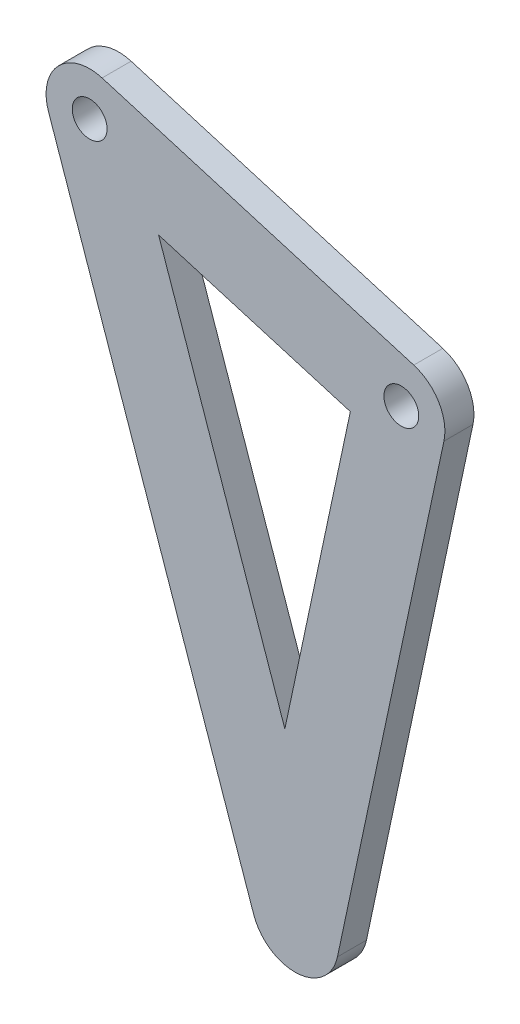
ISO-10303-21;
HEADER;
FILE_DESCRIPTION(('STEP AP214'),'2;1');
FILE_NAME('part.step','',(''),(''),'','','');
FILE_SCHEMA(('AUTOMOTIVE_DESIGN { 1 0 10303 214 1 1 1 1 }'));
ENDSEC;
DATA;
#1=APPLICATION_CONTEXT('core data for automotive mechanical design processes');
#2=APPLICATION_PROTOCOL_DEFINITION('international standard','automotive_design',2000,#1);
#3=PRODUCT_CONTEXT('',#1,'mechanical');
#4=PRODUCT('Part','Part','',(#3));
#5=PRODUCT_RELATED_PRODUCT_CATEGORY('part','',(#4));
#6=PRODUCT_DEFINITION_FORMATION('','',#4);
#7=PRODUCT_DEFINITION_CONTEXT('part definition',#1,'design');
#8=PRODUCT_DEFINITION('design','',#6,#7);
#9=PRODUCT_DEFINITION_SHAPE('','',#8);
#10=(LENGTH_UNIT() NAMED_UNIT(*) SI_UNIT(.MILLI.,.METRE.));
#11=(NAMED_UNIT(*) PLANE_ANGLE_UNIT() SI_UNIT($,.RADIAN.));
#12=(NAMED_UNIT(*) SI_UNIT($,.STERADIAN.) SOLID_ANGLE_UNIT());
#13=UNCERTAINTY_MEASURE_WITH_UNIT(LENGTH_MEASURE(1.E-05),#10,'distance_accuracy_value','');
#14=(GEOMETRIC_REPRESENTATION_CONTEXT(3) GLOBAL_UNCERTAINTY_ASSIGNED_CONTEXT((#13)) GLOBAL_UNIT_ASSIGNED_CONTEXT((#10,
#11,#12)) REPRESENTATION_CONTEXT('',''));
#15=CARTESIAN_POINT('',(0.,0.,0.));
#16=DIRECTION('',(0.,0.,1.));
#17=DIRECTION('',(1.,0.,0.));
#18=AXIS2_PLACEMENT_3D('',#15,#16,#17);
#19=CARTESIAN_POINT('',(-76.8798993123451,16.3749967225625,-5.));
#20=DIRECTION('',(-0.978060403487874,0.208321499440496,0.));
#21=DIRECTION('',(-0.208321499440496,-0.978060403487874,0.));
#22=AXIS2_PLACEMENT_3D('',#19,#20,#21);
#23=PLANE('',#22);
#24=DIRECTION('',(-0.208321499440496,-0.978060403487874,0.));
#25=VECTOR('',#24,1.);
#26=CARTESIAN_POINT('',(-76.8798993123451,16.3749967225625,0.));
#27=LINE('',#26,#25);
#28=CARTESIAN_POINT('',(-93.4175999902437,-61.2687906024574,0.));
#29=VERTEX_POINT('',#28);
#30=CARTESIAN_POINT('',(-104.696691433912,-114.223635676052,0.));
#31=VERTEX_POINT('',#30);
#32=EDGE_CURVE('E156',#29,#31,#27,.T.);
#33=ORIENTED_EDGE('',*,*,#32,.F.);
#34=DIRECTION('',(0.,0.,1.));
#35=VECTOR('',#34,1.);
#36=CARTESIAN_POINT('',(-93.4175999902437,-61.2687906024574,-5.));
#37=LINE('',#36,#35);
#38=CARTESIAN_POINT('',(-93.4175999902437,-61.2687906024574,-5.));
#39=VERTEX_POINT('',#38);
#40=EDGE_CURVE('E11',#39,#29,#37,.T.);
#41=ORIENTED_EDGE('',*,*,#40,.F.);
#42=DIRECTION('',(-0.208321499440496,-0.978060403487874,0.));
#43=VECTOR('',#42,1.);
#44=CARTESIAN_POINT('',(-76.8798993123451,16.3749967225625,-5.));
#45=LINE('',#44,#43);
#46=CARTESIAN_POINT('',(-104.696691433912,-114.223635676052,-5.));
#47=VERTEX_POINT('',#46);
#48=EDGE_CURVE('E127',#39,#47,#45,.T.);
#49=ORIENTED_EDGE('',*,*,#48,.T.);
#50=DIRECTION('',(0.,0.,1.));
#51=VECTOR('',#50,1.);
#52=CARTESIAN_POINT('',(-104.696691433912,-114.223635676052,-5.));
#53=LINE('',#52,#51);
#54=EDGE_CURVE('E116',#47,#31,#53,.T.);
#55=ORIENTED_EDGE('',*,*,#54,.T.);
#56=EDGE_LOOP('',(#33,#41,#49,#55));
#57=FACE_BOUND('',#56,.T.);
#58=ADVANCED_FACE('F39',(#57),#23,.T.);
#59=CARTESIAN_POINT('',(-24.3745831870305,-81.8336231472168,-5.));
#60=DIRECTION('',(-0.285461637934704,-0.958390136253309,0.));
#61=DIRECTION('',(0.958390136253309,-0.285461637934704,0.));
#62=AXIS2_PLACEMENT_3D('',#59,#60,#61);
#63=PLANE('',#62);
#64=DIRECTION('',(0.958390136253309,-0.285461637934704,0.));
#65=VECTOR('',#64,1.);
#66=CARTESIAN_POINT('',(-24.3745831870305,-81.8336231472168,0.));
#67=LINE('',#66,#65);
#68=CARTESIAN_POINT('',(-126.438409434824,-51.4333655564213,0.));
#69=VERTEX_POINT('',#68);
#70=EDGE_CURVE('E159',#69,#29,#67,.T.);
#71=ORIENTED_EDGE('',*,*,#70,.F.);
#72=DIRECTION('',(0.,0.,1.));
#73=VECTOR('',#72,1.);
#74=CARTESIAN_POINT('',(-126.438409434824,-51.4333655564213,-5.));
#75=LINE('',#74,#73);
#76=CARTESIAN_POINT('',(-126.438409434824,-51.4333655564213,-5.));
#77=VERTEX_POINT('',#76);
#78=EDGE_CURVE('E49',#77,#69,#75,.T.);
#79=ORIENTED_EDGE('',*,*,#78,.F.);
#80=DIRECTION('',(0.958390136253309,-0.285461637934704,0.));
#81=VECTOR('',#80,1.);
#82=CARTESIAN_POINT('',(-24.3745831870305,-81.8336231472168,-5.));
#83=LINE('',#82,#81);
#84=EDGE_CURVE('E128',#77,#39,#83,.T.);
#85=ORIENTED_EDGE('',*,*,#84,.T.);
#86=ORIENTED_EDGE('',*,*,#40,.T.);
#87=EDGE_LOOP('',(#71,#79,#85,#86));
#88=FACE_BOUND('',#87,.T.);
#89=ADVANCED_FACE('F228',(#88),#63,.T.);
#90=CARTESIAN_POINT('',(-142.978925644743,-49.5077895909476,-5.));
#91=DIRECTION('',(0.944955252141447,0.327199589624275,0.));
#92=DIRECTION('',(-0.327199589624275,0.944955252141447,0.));
#93=AXIS2_PLACEMENT_3D('',#90,#91,#92);
#94=PLANE('',#93);
#95=DIRECTION('',(-0.327199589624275,0.944955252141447,0.));
#96=VECTOR('',#95,1.);
#97=CARTESIAN_POINT('',(-142.978925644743,-49.5077895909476,0.));
#98=LINE('',#97,#96);
#99=CARTESIAN_POINT('',(-110.058903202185,-144.581099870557,0.));
#100=VERTEX_POINT('',#99);
#101=CARTESIAN_POINT('',(-145.396458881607,-42.5259326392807,0.));
#102=VERTEX_POINT('',#101);
#103=EDGE_CURVE('E138',#100,#102,#98,.T.);
#104=ORIENTED_EDGE('',*,*,#103,.T.);
#105=DIRECTION('',(0.,0.,1.));
#106=VECTOR('',#105,1.);
#107=CARTESIAN_POINT('',(-145.396458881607,-42.5259326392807,-5.));
#108=LINE('',#107,#106);
#109=CARTESIAN_POINT('',(-145.396458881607,-42.5259326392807,-5.));
#110=VERTEX_POINT('',#109);
#111=EDGE_CURVE('E123',#110,#102,#108,.T.);
#112=ORIENTED_EDGE('',*,*,#111,.F.);
#113=DIRECTION('',(-0.327199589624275,0.944955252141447,0.));
#114=VECTOR('',#113,1.);
#115=CARTESIAN_POINT('',(-142.978925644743,-49.5077895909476,-5.));
#116=LINE('',#115,#114);
#117=CARTESIAN_POINT('',(-110.058903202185,-144.581099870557,-5.));
#118=VERTEX_POINT('',#117);
#119=EDGE_CURVE('E161',#118,#110,#116,.T.);
#120=ORIENTED_EDGE('',*,*,#119,.F.);
#121=DIRECTION('',(0.,0.,1.));
#122=VECTOR('',#121,1.);
#123=CARTESIAN_POINT('',(-110.058903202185,-144.581099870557,-5.));
#124=LINE('',#123,#122);
#125=EDGE_CURVE('E99',#118,#100,#124,.T.);
#126=ORIENTED_EDGE('',*,*,#125,.T.);
#127=EDGE_LOOP('',(#104,#112,#120,#126));
#128=FACE_BOUND('',#127,.T.);
#129=ADVANCED_FACE('F41',(#128),#94,.F.);
#130=CARTESIAN_POINT('',(-138.309294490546,-40.0719357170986,-5.));
#131=DIRECTION('',(0.,0.,1.));
#132=DIRECTION('',(1.,0.,0.));
#133=AXIS2_PLACEMENT_3D('',#130,#131,#132);
#134=CYLINDRICAL_SURFACE('',#133,7.50000000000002);
#135=CARTESIAN_POINT('',(-138.309294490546,-40.0719357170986,0.));
#136=DIRECTION('',(0.,0.,1.));
#137=DIRECTION('',(1.,0.,0.));
#138=AXIS2_PLACEMENT_3D('',#135,#136,#137);
#139=CIRCLE('',#138,7.50000000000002);
#140=CARTESIAN_POINT('',(-136.168332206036,-32.8840096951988,0.));
#141=VERTEX_POINT('',#140);
#142=EDGE_CURVE('E153',#141,#102,#139,.T.);
#143=ORIENTED_EDGE('',*,*,#142,.F.);
#144=DIRECTION('',(0.,0.,1.));
#145=VECTOR('',#144,1.);
#146=CARTESIAN_POINT('',(-136.168332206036,-32.8840096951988,-5.));
#147=LINE('',#146,#145);
#148=CARTESIAN_POINT('',(-136.168332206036,-32.8840096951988,-5.));
#149=VERTEX_POINT('',#148);
#150=EDGE_CURVE('E165',#149,#141,#147,.T.);
#151=ORIENTED_EDGE('',*,*,#150,.F.);
#152=CARTESIAN_POINT('',(-138.309294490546,-40.0719357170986,-5.));
#153=DIRECTION('',(0.,0.,1.));
#154=DIRECTION('',(1.,0.,0.));
#155=AXIS2_PLACEMENT_3D('',#152,#153,#154);
#156=CIRCLE('',#155,7.50000000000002);
#157=EDGE_CURVE('E130',#149,#110,#156,.T.);
#158=ORIENTED_EDGE('',*,*,#157,.T.);
#159=ORIENTED_EDGE('',*,*,#111,.T.);
#160=EDGE_LOOP('',(#143,#151,#158,#159));
#161=FACE_BOUND('',#160,.T.);
#162=ADVANCED_FACE('F220',(#161),#134,.T.);
#163=CARTESIAN_POINT('',(-20.0926586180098,-67.457771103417,-5.));
#164=DIRECTION('',(-0.285461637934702,-0.95839013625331,0.));
#165=DIRECTION('',(0.95839013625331,-0.285461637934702,0.));
#166=AXIS2_PLACEMENT_3D('',#163,#164,#165);
#167=PLANE('',#166);
#168=DIRECTION('',(0.958390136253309,-0.285461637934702,0.));
#169=VECTOR('',#168,1.);
#170=CARTESIAN_POINT('',(-20.0926586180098,-67.457771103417,0.));
#171=LINE('',#170,#169);
#172=CARTESIAN_POINT('',(-82.4984845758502,-48.8698614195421,0.));
#173=VERTEX_POINT('',#172);
#174=EDGE_CURVE('E150',#141,#173,#171,.T.);
#175=ORIENTED_EDGE('',*,*,#174,.T.);
#176=DIRECTION('',(0.,0.,1.));
#177=VECTOR('',#176,1.);
#178=CARTESIAN_POINT('',(-82.4984845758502,-48.8698614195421,-5.));
#179=LINE('',#178,#177);
#180=CARTESIAN_POINT('',(-82.4984845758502,-48.8698614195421,-5.));
#181=VERTEX_POINT('',#180);
#182=EDGE_CURVE('E167',#181,#173,#179,.T.);
#183=ORIENTED_EDGE('',*,*,#182,.F.);
#184=DIRECTION('',(0.958390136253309,-0.285461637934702,0.));
#185=VECTOR('',#184,1.);
#186=CARTESIAN_POINT('',(-20.0926586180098,-67.457771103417,-5.));
#187=LINE('',#186,#185);
#188=EDGE_CURVE('E133',#149,#181,#187,.T.);
#189=ORIENTED_EDGE('',*,*,#188,.F.);
#190=ORIENTED_EDGE('',*,*,#150,.T.);
#191=EDGE_LOOP('',(#175,#183,#189,#190));
#192=FACE_BOUND('',#191,.T.);
#193=ADVANCED_FACE('F200',(#192),#167,.F.);
#194=CARTESIAN_POINT('',(-84.6394468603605,-56.057787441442,-5.));
#195=DIRECTION('',(0.,0.,1.));
#196=DIRECTION('',(1.,0.,0.));
#197=AXIS2_PLACEMENT_3D('',#194,#195,#196);
#198=CYLINDRICAL_SURFACE('',#197,7.50000000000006);
#199=CARTESIAN_POINT('',(-84.6394468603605,-56.057787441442,0.));
#200=DIRECTION('',(0.,0.,1.));
#201=DIRECTION('',(1.,0.,0.));
#202=AXIS2_PLACEMENT_3D('',#199,#200,#201);
#203=CIRCLE('',#202,7.50000000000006);
#204=CARTESIAN_POINT('',(-77.3039938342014,-57.6201986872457,0.));
#205=VERTEX_POINT('',#204);
#206=EDGE_CURVE('E147',#205,#173,#203,.T.);
#207=ORIENTED_EDGE('',*,*,#206,.F.);
#208=DIRECTION('',(0.,0.,1.));
#209=VECTOR('',#208,1.);
#210=CARTESIAN_POINT('',(-77.3039938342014,-57.6201986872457,-5.));
#211=LINE('',#210,#209);
#212=CARTESIAN_POINT('',(-77.3039938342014,-57.6201986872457,-5.));
#213=VERTEX_POINT('',#212);
#214=EDGE_CURVE('E169',#213,#205,#211,.T.);
#215=ORIENTED_EDGE('',*,*,#214,.F.);
#216=CARTESIAN_POINT('',(-84.6394468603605,-56.057787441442,-5.));
#217=DIRECTION('',(0.,0.,1.));
#218=DIRECTION('',(1.,0.,0.));
#219=AXIS2_PLACEMENT_3D('',#216,#217,#218);
#220=CIRCLE('',#219,7.50000000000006);
#221=EDGE_CURVE('E192',#213,#181,#220,.T.);
#222=ORIENTED_EDGE('',*,*,#221,.T.);
#223=ORIENTED_EDGE('',*,*,#182,.T.);
#224=EDGE_LOOP('',(#207,#215,#222,#223));
#225=FACE_BOUND('',#224,.T.);
#226=ADVANCED_FACE('F204',(#225),#198,.T.);
#227=CARTESIAN_POINT('',(-62.208993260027,13.250174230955,-5.));
#228=DIRECTION('',(-0.978060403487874,0.208321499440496,0.));
#229=DIRECTION('',(-0.208321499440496,-0.978060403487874,0.));
#230=AXIS2_PLACEMENT_3D('',#227,#228,#229);
#231=PLANE('',#230);
#232=DIRECTION('',(-0.208321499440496,-0.978060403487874,0.));
#233=VECTOR('',#232,1.);
#234=CARTESIAN_POINT('',(-62.208993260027,13.250174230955,0.));
#235=LINE('',#234,#233);
#236=CARTESIAN_POINT('',(-95.636285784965,-143.689514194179,0.));
#237=VERTEX_POINT('',#236);
#238=EDGE_CURVE('E144',#205,#237,#235,.T.);
#239=ORIENTED_EDGE('',*,*,#238,.T.);
#240=DIRECTION('',(0.,0.,1.));
#241=VECTOR('',#240,1.);
#242=CARTESIAN_POINT('',(-95.636285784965,-143.689514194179,-5.));
#243=LINE('',#242,#241);
#244=CARTESIAN_POINT('',(-95.636285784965,-143.689514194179,-5.));
#245=VERTEX_POINT('',#244);
#246=EDGE_CURVE('E171',#245,#237,#243,.T.);
#247=ORIENTED_EDGE('',*,*,#246,.F.);
#248=DIRECTION('',(-0.208321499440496,-0.978060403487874,0.));
#249=VECTOR('',#248,1.);
#250=CARTESIAN_POINT('',(-62.208993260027,13.250174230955,-5.));
#251=LINE('',#250,#249);
#252=EDGE_CURVE('E190',#213,#245,#251,.T.);
#253=ORIENTED_EDGE('',*,*,#252,.F.);
#254=ORIENTED_EDGE('',*,*,#214,.T.);
#255=EDGE_LOOP('',(#239,#247,#253,#254));
#256=FACE_BOUND('',#255,.T.);
#257=ADVANCED_FACE('F209',(#256),#231,.F.);
#258=CARTESIAN_POINT('',(-102.971738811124,-142.127102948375,-5.));
#259=DIRECTION('',(0.,0.,1.));
#260=DIRECTION('',(1.,0.,0.));
#261=AXIS2_PLACEMENT_3D('',#258,#259,#260);
#262=CYLINDRICAL_SURFACE('',#261,7.50000000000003);
#263=CARTESIAN_POINT('',(-102.971738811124,-142.127102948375,0.));
#264=DIRECTION('',(0.,0.,1.));
#265=DIRECTION('',(1.,0.,0.));
#266=AXIS2_PLACEMENT_3D('',#263,#264,#265);
#267=CIRCLE('',#266,7.50000000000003);
#268=EDGE_CURVE('E141',#100,#237,#267,.T.);
#269=ORIENTED_EDGE('',*,*,#268,.F.);
#270=ORIENTED_EDGE('',*,*,#125,.F.);
#271=CARTESIAN_POINT('',(-102.971738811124,-142.127102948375,-5.));
#272=DIRECTION('',(0.,0.,1.));
#273=DIRECTION('',(1.,0.,0.));
#274=AXIS2_PLACEMENT_3D('',#271,#272,#273);
#275=CIRCLE('',#274,7.50000000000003);
#276=EDGE_CURVE('E188',#118,#245,#275,.T.);
#277=ORIENTED_EDGE('',*,*,#276,.T.);
#278=ORIENTED_EDGE('',*,*,#246,.T.);
#279=EDGE_LOOP('',(#269,#270,#277,#278));
#280=FACE_BOUND('',#279,.T.);
#281=ADVANCED_FACE('F212',(#280),#262,.T.);
#282=CARTESIAN_POINT('',(-128.804596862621,-44.5997957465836,-5.));
#283=DIRECTION('',(0.944955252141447,0.327199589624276,0.));
#284=DIRECTION('',(-0.327199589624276,0.944955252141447,0.));
#285=AXIS2_PLACEMENT_3D('',#282,#283,#284);
#286=PLANE('',#285);
#287=DIRECTION('',(-0.327199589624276,0.944955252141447,0.));
#288=VECTOR('',#287,1.);
#289=CARTESIAN_POINT('',(-128.804596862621,-44.5997957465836,0.));
#290=LINE('',#289,#288);
#291=EDGE_CURVE('E121',#31,#69,#290,.T.);
#292=ORIENTED_EDGE('',*,*,#291,.F.);
#293=ORIENTED_EDGE('',*,*,#54,.F.);
#294=DIRECTION('',(-0.327199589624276,0.944955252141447,0.));
#295=VECTOR('',#294,1.);
#296=CARTESIAN_POINT('',(-128.804596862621,-44.5997957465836,-5.));
#297=LINE('',#296,#295);
#298=EDGE_CURVE('E119',#47,#77,#297,.T.);
#299=ORIENTED_EDGE('',*,*,#298,.T.);
#300=ORIENTED_EDGE('',*,*,#78,.T.);
#301=EDGE_LOOP('',(#292,#293,#299,#300));
#302=FACE_BOUND('',#301,.T.);
#303=ADVANCED_FACE('F118',(#302),#286,.T.);
#304=CARTESIAN_POINT('',(0.,0.,-5.));
#305=DIRECTION('',(0.,0.,1.));
#306=DIRECTION('',(1.,0.,0.));
#307=AXIS2_PLACEMENT_3D('',#304,#305,#306);
#308=PLANE('',#307);
#309=CARTESIAN_POINT('',(-138.309294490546,-40.0719357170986,-5.));
#310=DIRECTION('',(0.,0.,1.));
#311=DIRECTION('',(1.,0.,0.));
#312=AXIS2_PLACEMENT_3D('',#309,#310,#311);
#313=CIRCLE('',#312,2.99999999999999);
#314=CARTESIAN_POINT('',(-135.309294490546,-40.0719357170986,-5.));
#315=VERTEX_POINT('',#314);
#316=EDGE_CURVE('E175',#315,#315,#313,.T.);
#317=ORIENTED_EDGE('',*,*,#316,.T.);
#318=EDGE_LOOP('',(#317));
#319=FACE_BOUND('',#318,.T.);
#320=CARTESIAN_POINT('',(-84.6394468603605,-56.057787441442,-5.));
#321=DIRECTION('',(0.,0.,1.));
#322=DIRECTION('',(1.,0.,0.));
#323=AXIS2_PLACEMENT_3D('',#320,#321,#322);
#324=CIRCLE('',#323,3.00000000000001);
#325=CARTESIAN_POINT('',(-81.6394468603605,-56.057787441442,-5.));
#326=VERTEX_POINT('',#325);
#327=EDGE_CURVE('E180',#326,#326,#324,.T.);
#328=ORIENTED_EDGE('',*,*,#327,.T.);
#329=EDGE_LOOP('',(#328));
#330=FACE_BOUND('',#329,.T.);
#331=ORIENTED_EDGE('',*,*,#119,.T.);
#332=ORIENTED_EDGE('',*,*,#157,.F.);
#333=ORIENTED_EDGE('',*,*,#188,.T.);
#334=ORIENTED_EDGE('',*,*,#221,.F.);
#335=ORIENTED_EDGE('',*,*,#252,.T.);
#336=ORIENTED_EDGE('',*,*,#276,.F.);
#337=EDGE_LOOP('',(#331,#332,#333,#334,#335,#336));
#338=FACE_BOUND('',#337,.T.);
#339=ORIENTED_EDGE('',*,*,#48,.F.);
#340=ORIENTED_EDGE('',*,*,#84,.F.);
#341=ORIENTED_EDGE('',*,*,#298,.F.);
#342=EDGE_LOOP('',(#339,#340,#341));
#343=FACE_BOUND('',#342,.T.);
#344=ADVANCED_FACE('F126',(#319,#330,#338,#343),#308,.F.);
#345=CARTESIAN_POINT('',(0.,0.,0.));
#346=DIRECTION('',(0.,0.,1.));
#347=DIRECTION('',(1.,0.,0.));
#348=AXIS2_PLACEMENT_3D('',#345,#346,#347);
#349=PLANE('',#348);
#350=CARTESIAN_POINT('',(-138.309294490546,-40.0719357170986,0.));
#351=DIRECTION('',(0.,0.,1.));
#352=DIRECTION('',(1.,0.,0.));
#353=AXIS2_PLACEMENT_3D('',#350,#351,#352);
#354=CIRCLE('',#353,2.99999999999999);
#355=CARTESIAN_POINT('',(-135.309294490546,-40.0719357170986,0.));
#356=VERTEX_POINT('',#355);
#357=EDGE_CURVE('E43',#356,#356,#354,.T.);
#358=ORIENTED_EDGE('',*,*,#357,.F.);
#359=EDGE_LOOP('',(#358));
#360=FACE_BOUND('',#359,.T.);
#361=CARTESIAN_POINT('',(-84.6394468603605,-56.057787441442,0.));
#362=DIRECTION('',(0.,0.,1.));
#363=DIRECTION('',(1.,0.,0.));
#364=AXIS2_PLACEMENT_3D('',#361,#362,#363);
#365=CIRCLE('',#364,3.00000000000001);
#366=CARTESIAN_POINT('',(-81.6394468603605,-56.057787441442,0.));
#367=VERTEX_POINT('',#366);
#368=EDGE_CURVE('E173',#367,#367,#365,.T.);
#369=ORIENTED_EDGE('',*,*,#368,.F.);
#370=EDGE_LOOP('',(#369));
#371=FACE_BOUND('',#370,.T.);
#372=ORIENTED_EDGE('',*,*,#103,.F.);
#373=ORIENTED_EDGE('',*,*,#268,.T.);
#374=ORIENTED_EDGE('',*,*,#238,.F.);
#375=ORIENTED_EDGE('',*,*,#206,.T.);
#376=ORIENTED_EDGE('',*,*,#174,.F.);
#377=ORIENTED_EDGE('',*,*,#142,.T.);
#378=EDGE_LOOP('',(#372,#373,#374,#375,#376,#377));
#379=FACE_BOUND('',#378,.T.);
#380=ORIENTED_EDGE('',*,*,#32,.T.);
#381=ORIENTED_EDGE('',*,*,#291,.T.);
#382=ORIENTED_EDGE('',*,*,#70,.T.);
#383=EDGE_LOOP('',(#380,#381,#382));
#384=FACE_BOUND('',#383,.T.);
#385=ADVANCED_FACE('F215',(#360,#371,#379,#384),#349,.T.);
#386=CARTESIAN_POINT('',(-84.6394468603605,-56.057787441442,-5.));
#387=DIRECTION('',(0.,0.,1.));
#388=DIRECTION('',(1.,0.,0.));
#389=AXIS2_PLACEMENT_3D('',#386,#387,#388);
#390=CYLINDRICAL_SURFACE('',#389,3.00000000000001);
#391=ORIENTED_EDGE('',*,*,#368,.T.);
#392=EDGE_LOOP('',(#391));
#393=FACE_BOUND('',#392,.T.);
#394=ORIENTED_EDGE('',*,*,#327,.F.);
#395=EDGE_LOOP('',(#394));
#396=FACE_BOUND('',#395,.T.);
#397=ADVANCED_FACE('F240',(#393,#396),#390,.F.);
#398=CARTESIAN_POINT('',(-138.309294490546,-40.0719357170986,-5.));
#399=DIRECTION('',(0.,0.,1.));
#400=DIRECTION('',(1.,0.,0.));
#401=AXIS2_PLACEMENT_3D('',#398,#399,#400);
#402=CYLINDRICAL_SURFACE('',#401,2.99999999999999);
#403=ORIENTED_EDGE('',*,*,#357,.T.);
#404=EDGE_LOOP('',(#403));
#405=FACE_BOUND('',#404,.T.);
#406=ORIENTED_EDGE('',*,*,#316,.F.);
#407=EDGE_LOOP('',(#406));
#408=FACE_BOUND('',#407,.T.);
#409=ADVANCED_FACE('F246',(#405,#408),#402,.F.);
#410=CLOSED_SHELL('',(#58,#89,#129,#162,#193,#226,#257,#281,#303,#344,#385,#397,#409));
#411=MANIFOLD_SOLID_BREP('B2',#410);
#412=ADVANCED_BREP_SHAPE_REPRESENTATION('',(#18,#411),#14);
#413=SHAPE_DEFINITION_REPRESENTATION(#9,#412);
ENDSEC;
END-ISO-10303-21;
